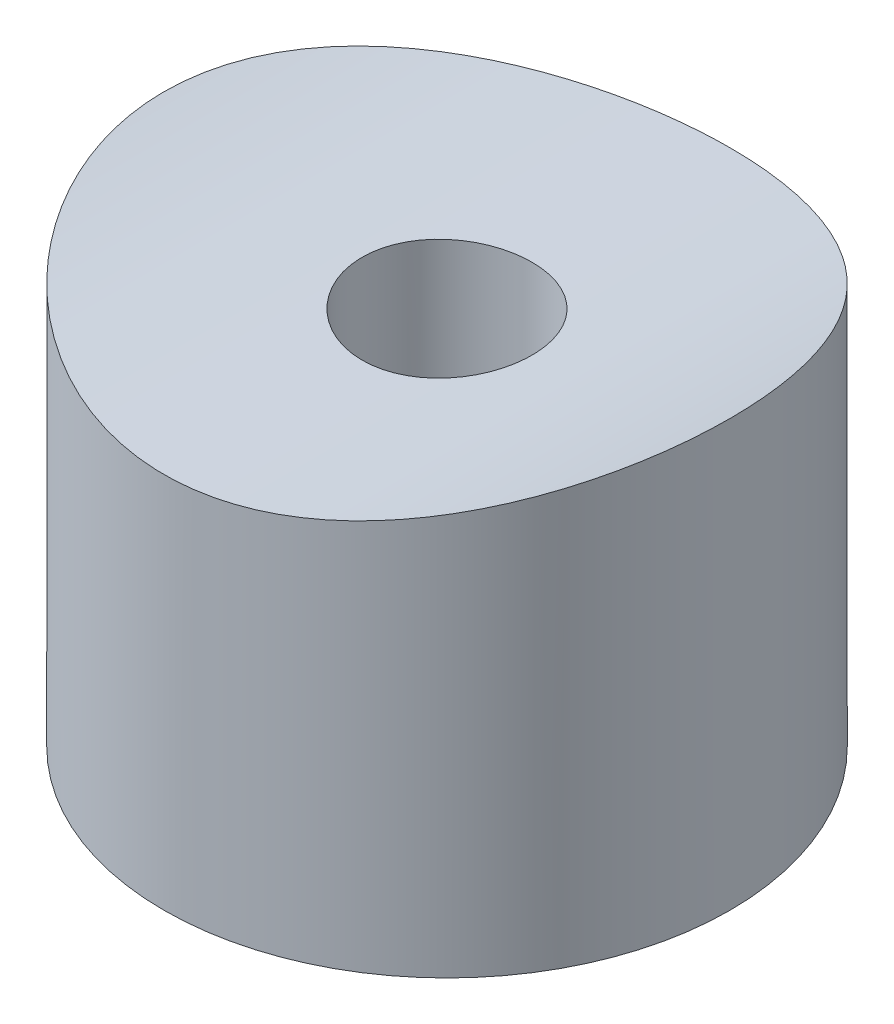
from build123d import *

# Parameters (mm, degrees)
SKETCH2_R          = 7.5
SKETCH2_R_2        = 2.25
EXTRUDE1_DEPTH     = 12
SKETCH3_R          = 22.5
CUT_EXTRUDE1_DEPTH = 10


with BuildPart() as part:
    # Sketch2 → Extrude1 (new body)
    with BuildSketch(Plane(origin=(0, 0, 0), x_dir=(1, 0, 0), z_dir=(0, 1, 0))):
        with Locations(Location((0, 0, 0), (0, 0, 270))):
            Circle(SKETCH2_R)
        with Locations(Location((0, 0, 0), (0, 0, 270))):
            Circle(SKETCH2_R_2, mode=Mode.SUBTRACT)
    extrude(amount=EXTRUDE1_DEPTH)

    # Sketch3 → Cut-Extrude1 (cut, symmetric)
    with BuildSketch(Plane.XY):
        with Locations((0, 32.5)):
            Circle(SKETCH3_R)
    extrude(amount=CUT_EXTRUDE1_DEPTH, both=True, mode=Mode.SUBTRACT)


solid = part.part
